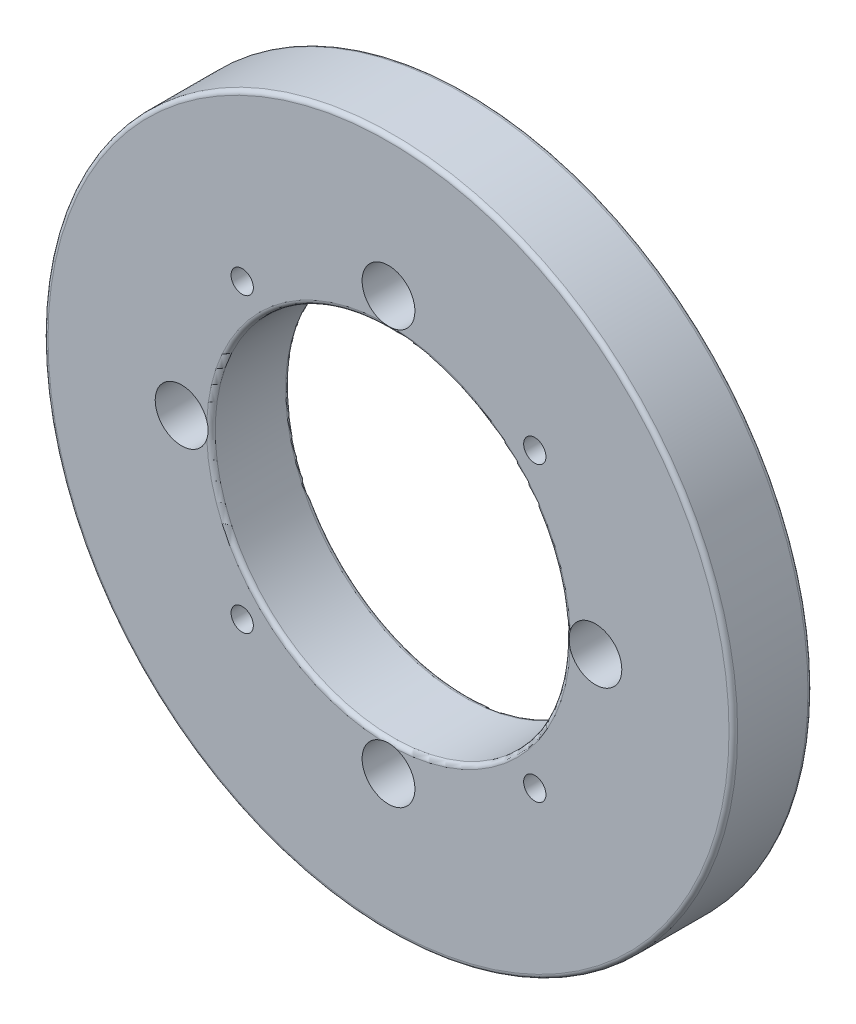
ISO-10303-21;
HEADER;
FILE_DESCRIPTION(('STEP AP214'),'2;1');
FILE_NAME('part.step','',(''),(''),'','','');
FILE_SCHEMA(('AUTOMOTIVE_DESIGN { 1 0 10303 214 1 1 1 1 }'));
ENDSEC;
DATA;
#1=APPLICATION_CONTEXT('core data for automotive mechanical design processes');
#2=APPLICATION_PROTOCOL_DEFINITION('international standard','automotive_design',2000,#1);
#3=PRODUCT_CONTEXT('',#1,'mechanical');
#4=PRODUCT('Part','Part','',(#3));
#5=PRODUCT_RELATED_PRODUCT_CATEGORY('part','',(#4));
#6=PRODUCT_DEFINITION_FORMATION('','',#4);
#7=PRODUCT_DEFINITION_CONTEXT('part definition',#1,'design');
#8=PRODUCT_DEFINITION('design','',#6,#7);
#9=PRODUCT_DEFINITION_SHAPE('','',#8);
#10=(LENGTH_UNIT() NAMED_UNIT(*) SI_UNIT(.MILLI.,.METRE.));
#11=(NAMED_UNIT(*) PLANE_ANGLE_UNIT() SI_UNIT($,.RADIAN.));
#12=(NAMED_UNIT(*) SI_UNIT($,.STERADIAN.) SOLID_ANGLE_UNIT());
#13=UNCERTAINTY_MEASURE_WITH_UNIT(LENGTH_MEASURE(1.E-05),#10,'distance_accuracy_value','');
#14=(GEOMETRIC_REPRESENTATION_CONTEXT(3) GLOBAL_UNCERTAINTY_ASSIGNED_CONTEXT((#13)) GLOBAL_UNIT_ASSIGNED_CONTEXT((#10,
#11,#12)) REPRESENTATION_CONTEXT('',''));
#15=CARTESIAN_POINT('',(0.,0.,0.));
#16=DIRECTION('',(0.,0.,1.));
#17=DIRECTION('',(1.,0.,0.));
#18=AXIS2_PLACEMENT_3D('',#15,#16,#17);
#19=CARTESIAN_POINT('',(0.,0.,29.0957));
#20=DIRECTION('',(0.,0.,1.));
#21=DIRECTION('',(1.,0.,0.));
#22=AXIS2_PLACEMENT_3D('',#19,#20,#21);
#23=PLANE('',#22);
#24=CARTESIAN_POINT('',(-53.8815367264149,53.8815367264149,29.0957));
#25=DIRECTION('',(0.,0.,1.));
#26=DIRECTION('',(1.,0.,0.));
#27=AXIS2_PLACEMENT_3D('',#24,#25,#26);
#28=CIRCLE('',#27,4.10209999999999);
#29=CARTESIAN_POINT('',(-49.7794367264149,53.8815367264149,29.0957));
#30=VERTEX_POINT('',#29);
#31=EDGE_CURVE('E336',#30,#30,#28,.T.);
#32=ORIENTED_EDGE('',*,*,#31,.F.);
#33=EDGE_LOOP('',(#32));
#34=FACE_BOUND('',#33,.T.);
#35=CARTESIAN_POINT('',(53.8815367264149,-53.8815367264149,29.0957));
#36=DIRECTION('',(0.,0.,1.));
#37=DIRECTION('',(1.,0.,0.));
#38=AXIS2_PLACEMENT_3D('',#35,#36,#37);
#39=CIRCLE('',#38,4.10209999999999);
#40=CARTESIAN_POINT('',(57.9836367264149,-53.8815367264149,29.0957));
#41=VERTEX_POINT('',#40);
#42=EDGE_CURVE('E329',#41,#41,#39,.T.);
#43=ORIENTED_EDGE('',*,*,#42,.F.);
#44=EDGE_LOOP('',(#43));
#45=FACE_BOUND('',#44,.T.);
#46=CARTESIAN_POINT('',(-53.8815367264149,-53.8815367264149,29.0957));
#47=DIRECTION('',(0.,0.,1.));
#48=DIRECTION('',(1.,0.,0.));
#49=AXIS2_PLACEMENT_3D('',#46,#47,#48);
#50=CIRCLE('',#49,4.10209999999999);
#51=CARTESIAN_POINT('',(-49.7794367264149,-53.8815367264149,29.0957));
#52=VERTEX_POINT('',#51);
#53=EDGE_CURVE('E321',#52,#52,#50,.T.);
#54=ORIENTED_EDGE('',*,*,#53,.F.);
#55=EDGE_LOOP('',(#54));
#56=FACE_BOUND('',#55,.T.);
#57=CARTESIAN_POINT('',(53.8815367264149,53.8815367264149,29.0957));
#58=DIRECTION('',(0.,0.,1.));
#59=DIRECTION('',(1.,0.,0.));
#60=AXIS2_PLACEMENT_3D('',#57,#58,#59);
#61=CIRCLE('',#60,4.10209999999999);
#62=CARTESIAN_POINT('',(57.9836367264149,53.8815367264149,29.0957));
#63=VERTEX_POINT('',#62);
#64=EDGE_CURVE('E304',#63,#63,#61,.T.);
#65=ORIENTED_EDGE('',*,*,#64,.F.);
#66=EDGE_LOOP('',(#65));
#67=FACE_BOUND('',#66,.T.);
#68=CARTESIAN_POINT('',(0.,0.,29.0957));
#69=DIRECTION('',(0.,0.,1.));
#70=DIRECTION('',(1.,0.,0.));
#71=AXIS2_PLACEMENT_3D('',#68,#69,#70);
#72=CIRCLE('',#71,125.4125);
#73=CARTESIAN_POINT('',(125.4125,0.,29.0957));
#74=VERTEX_POINT('',#73);
#75=EDGE_CURVE('E282',#74,#74,#72,.T.);
#76=ORIENTED_EDGE('',*,*,#75,.T.);
#77=EDGE_LOOP('',(#76));
#78=FACE_BOUND('',#77,.T.);
#79=CARTESIAN_POINT('',(0.,-76.2,29.0957));
#80=DIRECTION('',(0.,0.,1.));
#81=DIRECTION('',(-1.,0.,0.));
#82=AXIS2_PLACEMENT_3D('',#79,#80,#81);
#83=CIRCLE('',#82,9.7234375);
#84=CARTESIAN_POINT('',(-2.92965393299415,-66.9284108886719,29.0957));
#85=VERTEX_POINT('',#84);
#86=CARTESIAN_POINT('',(2.92965393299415,-66.9284108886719,29.0957));
#87=VERTEX_POINT('',#86);
#88=EDGE_CURVE('E308',#85,#87,#83,.T.);
#89=ORIENTED_EDGE('',*,*,#88,.F.);
#90=CARTESIAN_POINT('',(0.,0.,29.0957));
#91=DIRECTION('',(0.,0.,1.));
#92=DIRECTION('',(1.,0.,0.));
#93=AXIS2_PLACEMENT_3D('',#90,#91,#92);
#94=CIRCLE('',#93,66.9925);
#95=CARTESIAN_POINT('',(-66.9284108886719,-2.92965393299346,29.0957));
#96=VERTEX_POINT('',#95);
#97=EDGE_CURVE('E12',#85,#96,#94,.F.);
#98=ORIENTED_EDGE('',*,*,#97,.T.);
#99=CARTESIAN_POINT('',(-76.2,7.9815263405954E-13,29.0957));
#100=DIRECTION('',(0.,0.,1.));
#101=DIRECTION('',(0.,1.,0.));
#102=AXIS2_PLACEMENT_3D('',#99,#100,#101);
#103=CIRCLE('',#102,9.7234375);
#104=CARTESIAN_POINT('',(-66.9284108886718,2.92965393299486,29.0957));
#105=VERTEX_POINT('',#104);
#106=EDGE_CURVE('E299',#105,#96,#103,.T.);
#107=ORIENTED_EDGE('',*,*,#106,.F.);
#108=CARTESIAN_POINT('',(0.,0.,29.0957));
#109=DIRECTION('',(0.,0.,1.));
#110=DIRECTION('',(1.,0.,0.));
#111=AXIS2_PLACEMENT_3D('',#108,#109,#110);
#112=CIRCLE('',#111,66.9925);
#113=CARTESIAN_POINT('',(-2.92965393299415,66.9284108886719,29.0957));
#114=VERTEX_POINT('',#113);
#115=EDGE_CURVE('E60',#105,#114,#112,.F.);
#116=ORIENTED_EDGE('',*,*,#115,.T.);
#117=CARTESIAN_POINT('',(0.,76.2,29.0957));
#118=DIRECTION('',(0.,0.,1.));
#119=DIRECTION('',(1.,0.,0.));
#120=AXIS2_PLACEMENT_3D('',#117,#118,#119);
#121=CIRCLE('',#120,9.7234375);
#122=CARTESIAN_POINT('',(2.92965393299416,66.9284108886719,29.0957));
#123=VERTEX_POINT('',#122);
#124=EDGE_CURVE('E141',#123,#114,#121,.T.);
#125=ORIENTED_EDGE('',*,*,#124,.F.);
#126=CARTESIAN_POINT('',(0.,0.,29.0957));
#127=DIRECTION('',(0.,0.,1.));
#128=DIRECTION('',(1.,0.,0.));
#129=AXIS2_PLACEMENT_3D('',#126,#127,#128);
#130=CIRCLE('',#129,66.9925);
#131=CARTESIAN_POINT('',(66.9284108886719,2.92965393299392,29.0957));
#132=VERTEX_POINT('',#131);
#133=EDGE_CURVE('E360',#123,#132,#130,.F.);
#134=ORIENTED_EDGE('',*,*,#133,.T.);
#135=CARTESIAN_POINT('',(76.2,-2.66050878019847E-13,29.0957));
#136=DIRECTION('',(0.,0.,1.));
#137=DIRECTION('',(0.,-1.,0.));
#138=AXIS2_PLACEMENT_3D('',#135,#136,#137);
#139=CIRCLE('',#138,9.7234375);
#140=CARTESIAN_POINT('',(66.9284108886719,-2.92965393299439,29.0957));
#141=VERTEX_POINT('',#140);
#142=EDGE_CURVE('E142',#141,#132,#139,.T.);
#143=ORIENTED_EDGE('',*,*,#142,.F.);
#144=CARTESIAN_POINT('',(0.,0.,29.0957));
#145=DIRECTION('',(0.,0.,1.));
#146=DIRECTION('',(1.,0.,0.));
#147=AXIS2_PLACEMENT_3D('',#144,#145,#146);
#148=CIRCLE('',#147,66.9925);
#149=EDGE_CURVE('E355',#141,#87,#148,.F.);
#150=ORIENTED_EDGE('',*,*,#149,.T.);
#151=EDGE_LOOP('',(#89,#98,#107,#116,#125,#134,#143,#150));
#152=FACE_BOUND('',#151,.T.);
#153=ADVANCED_FACE('F50',(#34,#45,#56,#67,#78,#152),#23,.T.);
#154=CARTESIAN_POINT('',(0.,0.,0.));
#155=DIRECTION('',(0.,0.,1.));
#156=DIRECTION('',(1.,0.,0.));
#157=AXIS2_PLACEMENT_3D('',#154,#155,#156);
#158=PLANE('',#157);
#159=CARTESIAN_POINT('',(-53.8815367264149,53.8815367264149,0.));
#160=DIRECTION('',(0.,0.,-1.));
#161=DIRECTION('',(-1.,0.,0.));
#162=AXIS2_PLACEMENT_3D('',#159,#160,#161);
#163=CIRCLE('',#162,4.1021);
#164=CARTESIAN_POINT('',(-57.9836367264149,53.8815367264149,0.));
#165=VERTEX_POINT('',#164);
#166=EDGE_CURVE('E338',#165,#165,#163,.T.);
#167=ORIENTED_EDGE('',*,*,#166,.F.);
#168=EDGE_LOOP('',(#167));
#169=FACE_BOUND('',#168,.T.);
#170=CARTESIAN_POINT('',(53.8815367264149,-53.8815367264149,0.));
#171=DIRECTION('',(0.,0.,-1.));
#172=DIRECTION('',(-1.,0.,0.));
#173=AXIS2_PLACEMENT_3D('',#170,#171,#172);
#174=CIRCLE('',#173,4.1021);
#175=CARTESIAN_POINT('',(49.7794367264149,-53.8815367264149,0.));
#176=VERTEX_POINT('',#175);
#177=EDGE_CURVE('E332',#176,#176,#174,.T.);
#178=ORIENTED_EDGE('',*,*,#177,.F.);
#179=EDGE_LOOP('',(#178));
#180=FACE_BOUND('',#179,.T.);
#181=CARTESIAN_POINT('',(-53.8815367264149,-53.8815367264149,0.));
#182=DIRECTION('',(0.,0.,-1.));
#183=DIRECTION('',(-1.,0.,0.));
#184=AXIS2_PLACEMENT_3D('',#181,#182,#183);
#185=CIRCLE('',#184,4.1021);
#186=CARTESIAN_POINT('',(-57.9836367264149,-53.8815367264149,0.));
#187=VERTEX_POINT('',#186);
#188=EDGE_CURVE('E325',#187,#187,#185,.T.);
#189=ORIENTED_EDGE('',*,*,#188,.F.);
#190=EDGE_LOOP('',(#189));
#191=FACE_BOUND('',#190,.T.);
#192=CARTESIAN_POINT('',(53.8815367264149,53.8815367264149,0.));
#193=DIRECTION('',(0.,0.,-1.));
#194=DIRECTION('',(-1.,0.,0.));
#195=AXIS2_PLACEMENT_3D('',#192,#193,#194);
#196=CIRCLE('',#195,4.1021);
#197=CARTESIAN_POINT('',(49.7794367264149,53.8815367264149,0.));
#198=VERTEX_POINT('',#197);
#199=EDGE_CURVE('E318',#198,#198,#196,.T.);
#200=ORIENTED_EDGE('',*,*,#199,.F.);
#201=EDGE_LOOP('',(#200));
#202=FACE_BOUND('',#201,.T.);
#203=CARTESIAN_POINT('',(0.,0.,0.));
#204=DIRECTION('',(0.,0.,1.));
#205=DIRECTION('',(1.,0.,0.));
#206=AXIS2_PLACEMENT_3D('',#203,#204,#205);
#207=CIRCLE('',#206,125.4125);
#208=CARTESIAN_POINT('',(125.4125,0.,0.));
#209=VERTEX_POINT('',#208);
#210=EDGE_CURVE('E148',#209,#209,#207,.F.);
#211=ORIENTED_EDGE('',*,*,#210,.T.);
#212=EDGE_LOOP('',(#211));
#213=FACE_BOUND('',#212,.T.);
#214=CARTESIAN_POINT('',(0.,76.2,0.));
#215=DIRECTION('',(0.,0.,1.));
#216=DIRECTION('',(1.,0.,0.));
#217=AXIS2_PLACEMENT_3D('',#214,#215,#216);
#218=CIRCLE('',#217,9.7234375);
#219=CARTESIAN_POINT('',(2.92965393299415,66.9284108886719,0.));
#220=VERTEX_POINT('',#219);
#221=CARTESIAN_POINT('',(-2.92965393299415,66.9284108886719,0.));
#222=VERTEX_POINT('',#221);
#223=EDGE_CURVE('E286',#220,#222,#218,.T.);
#224=ORIENTED_EDGE('',*,*,#223,.T.);
#225=CARTESIAN_POINT('',(0.,0.,0.));
#226=DIRECTION('',(0.,0.,1.));
#227=DIRECTION('',(1.,0.,0.));
#228=AXIS2_PLACEMENT_3D('',#225,#226,#227);
#229=CIRCLE('',#228,66.9925);
#230=CARTESIAN_POINT('',(-66.9284108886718,2.92965393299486,0.));
#231=VERTEX_POINT('',#230);
#232=EDGE_CURVE('E161',#222,#231,#229,.T.);
#233=ORIENTED_EDGE('',*,*,#232,.T.);
#234=CARTESIAN_POINT('',(-76.2,7.9815263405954E-13,0.));
#235=DIRECTION('',(0.,0.,1.));
#236=DIRECTION('',(0.,1.,0.));
#237=AXIS2_PLACEMENT_3D('',#234,#235,#236);
#238=CIRCLE('',#237,9.7234375);
#239=CARTESIAN_POINT('',(-66.9284108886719,-2.92965393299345,0.));
#240=VERTEX_POINT('',#239);
#241=EDGE_CURVE('E303',#231,#240,#238,.T.);
#242=ORIENTED_EDGE('',*,*,#241,.T.);
#243=CARTESIAN_POINT('',(0.,0.,0.));
#244=DIRECTION('',(0.,0.,1.));
#245=DIRECTION('',(1.,0.,0.));
#246=AXIS2_PLACEMENT_3D('',#243,#244,#245);
#247=CIRCLE('',#246,66.9925);
#248=CARTESIAN_POINT('',(-2.92965393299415,-66.9284108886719,0.));
#249=VERTEX_POINT('',#248);
#250=EDGE_CURVE('E151',#240,#249,#247,.T.);
#251=ORIENTED_EDGE('',*,*,#250,.T.);
#252=CARTESIAN_POINT('',(0.,-76.2,0.));
#253=DIRECTION('',(0.,0.,1.));
#254=DIRECTION('',(-1.,0.,0.));
#255=AXIS2_PLACEMENT_3D('',#252,#253,#254);
#256=CIRCLE('',#255,9.7234375);
#257=CARTESIAN_POINT('',(2.92965393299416,-66.9284108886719,0.));
#258=VERTEX_POINT('',#257);
#259=EDGE_CURVE('E311',#249,#258,#256,.T.);
#260=ORIENTED_EDGE('',*,*,#259,.T.);
#261=CARTESIAN_POINT('',(0.,0.,0.));
#262=DIRECTION('',(0.,0.,1.));
#263=DIRECTION('',(1.,0.,0.));
#264=AXIS2_PLACEMENT_3D('',#261,#262,#263);
#265=CIRCLE('',#264,66.9925);
#266=CARTESIAN_POINT('',(66.9284108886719,-2.92965393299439,0.));
#267=VERTEX_POINT('',#266);
#268=EDGE_CURVE('E139',#258,#267,#265,.T.);
#269=ORIENTED_EDGE('',*,*,#268,.T.);
#270=CARTESIAN_POINT('',(76.2,-2.66050878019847E-13,0.));
#271=DIRECTION('',(0.,0.,1.));
#272=DIRECTION('',(0.,-1.,0.));
#273=AXIS2_PLACEMENT_3D('',#270,#271,#272);
#274=CIRCLE('',#273,9.7234375);
#275=CARTESIAN_POINT('',(66.9284108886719,2.92965393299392,0.));
#276=VERTEX_POINT('',#275);
#277=EDGE_CURVE('E127',#267,#276,#274,.T.);
#278=ORIENTED_EDGE('',*,*,#277,.T.);
#279=CARTESIAN_POINT('',(0.,0.,0.));
#280=DIRECTION('',(0.,0.,1.));
#281=DIRECTION('',(1.,0.,0.));
#282=AXIS2_PLACEMENT_3D('',#279,#280,#281);
#283=CIRCLE('',#282,66.9925);
#284=EDGE_CURVE('E136',#276,#220,#283,.T.);
#285=ORIENTED_EDGE('',*,*,#284,.T.);
#286=EDGE_LOOP('',(#224,#233,#242,#251,#260,#269,#278,#285));
#287=FACE_BOUND('',#286,.T.);
#288=ADVANCED_FACE('F135',(#169,#180,#191,#202,#213,#287),#158,.F.);
#289=CARTESIAN_POINT('',(0.,0.,29.0957));
#290=DIRECTION('',(0.,0.,-1.));
#291=DIRECTION('',(-1.,0.,0.));
#292=AXIS2_PLACEMENT_3D('',#289,#290,#291);
#293=CYLINDRICAL_SURFACE('',#292,127.);
#294=CARTESIAN_POINT('',(0.,0.,27.5082));
#295=DIRECTION('',(0.,0.,1.));
#296=DIRECTION('',(1.,0.,0.));
#297=AXIS2_PLACEMENT_3D('',#294,#295,#296);
#298=CIRCLE('',#297,127.);
#299=CARTESIAN_POINT('',(127.,0.,27.5082));
#300=VERTEX_POINT('',#299);
#301=EDGE_CURVE('E155',#300,#300,#298,.F.);
#302=ORIENTED_EDGE('',*,*,#301,.T.);
#303=EDGE_LOOP('',(#302));
#304=FACE_BOUND('',#303,.T.);
#305=CARTESIAN_POINT('',(0.,0.,1.5875));
#306=DIRECTION('',(0.,0.,1.));
#307=DIRECTION('',(1.,0.,0.));
#308=AXIS2_PLACEMENT_3D('',#305,#306,#307);
#309=CIRCLE('',#308,127.);
#310=CARTESIAN_POINT('',(127.,0.,1.5875));
#311=VERTEX_POINT('',#310);
#312=EDGE_CURVE('E285',#311,#311,#309,.T.);
#313=ORIENTED_EDGE('',*,*,#312,.T.);
#314=EDGE_LOOP('',(#313));
#315=FACE_BOUND('',#314,.T.);
#316=ADVANCED_FACE('F263',(#304,#315),#293,.T.);
#317=CARTESIAN_POINT('',(0.,0.,29.0957));
#318=DIRECTION('',(0.,0.,-1.));
#319=DIRECTION('',(-1.,0.,0.));
#320=AXIS2_PLACEMENT_3D('',#317,#318,#319);
#321=CYLINDRICAL_SURFACE('',#320,65.405);
#322=CARTESIAN_POINT('',(0.,0.,1.5875));
#323=DIRECTION('',(0.,0.,1.));
#324=DIRECTION('',(1.,0.,0.));
#325=AXIS2_PLACEMENT_3D('',#322,#323,#324);
#326=CIRCLE('',#325,65.405);
#327=CARTESIAN_POINT('',(65.405,0.,1.5875));
#328=VERTEX_POINT('',#327);
#329=EDGE_CURVE('E353',#328,#328,#326,.F.);
#330=ORIENTED_EDGE('',*,*,#329,.T.);
#331=EDGE_LOOP('',(#330));
#332=FACE_BOUND('',#331,.T.);
#333=CARTESIAN_POINT('',(0.,0.,27.5082));
#334=DIRECTION('',(0.,0.,1.));
#335=DIRECTION('',(1.,0.,0.));
#336=AXIS2_PLACEMENT_3D('',#333,#334,#335);
#337=CIRCLE('',#336,65.405);
#338=CARTESIAN_POINT('',(65.405,0.,27.5082));
#339=VERTEX_POINT('',#338);
#340=EDGE_CURVE('E208',#339,#339,#337,.T.);
#341=ORIENTED_EDGE('',*,*,#340,.T.);
#342=EDGE_LOOP('',(#341));
#343=FACE_BOUND('',#342,.T.);
#344=ADVANCED_FACE('F193',(#332,#343),#321,.F.);
#345=CARTESIAN_POINT('',(0.,76.2,0.));
#346=DIRECTION('',(0.,0.,1.));
#347=DIRECTION('',(1.,0.,0.));
#348=AXIS2_PLACEMENT_3D('',#345,#346,#347);
#349=CYLINDRICAL_SURFACE('',#348,9.7234375);
#350=ORIENTED_EDGE('',*,*,#223,.F.);
#351=CARTESIAN_POINT('',(2.92965393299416,66.9284108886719,0.));
#352=CARTESIAN_POINT('',(2.80301925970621,66.8883948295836,3.25155409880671E-05));
#353=CARTESIAN_POINT('',(2.6755915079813,66.8509851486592,0.00195686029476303));
#354=CARTESIAN_POINT('',(2.41939369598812,66.781434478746,0.00833920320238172));
#355=CARTESIAN_POINT('',(2.29062392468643,66.7492923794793,0.0127966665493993));
#356=CARTESIAN_POINT('',(2.03184266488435,66.6902954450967,0.0229998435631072));
#357=CARTESIAN_POINT('',(1.90183037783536,66.66344428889,0.0287464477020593));
#358=CARTESIAN_POINT('',(1.64081962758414,66.6150866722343,0.0404807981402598));
#359=CARTESIAN_POINT('',(1.50982111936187,66.5935804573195,0.0464685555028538));
#360=CARTESIAN_POINT('',(1.25034497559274,66.5564210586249,0.0576429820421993));
#361=CARTESIAN_POINT('',(1.12188726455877,66.5406337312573,0.0628460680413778));
#362=CARTESIAN_POINT('',(0.864398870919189,66.5141959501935,0.0719617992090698));
#363=CARTESIAN_POINT('',(0.735368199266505,66.5035453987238,0.0758744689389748));
#364=CARTESIAN_POINT('',(0.47701605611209,66.4874084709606,0.0819326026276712));
#365=CARTESIAN_POINT('',(0.34769479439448,66.4819191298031,0.0840790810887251));
#366=CARTESIAN_POINT('',(0.0889187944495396,66.4761078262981,0.0863538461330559));
#367=CARTESIAN_POINT('',(-0.0405359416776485,66.4757857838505,0.0864821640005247));
#368=CARTESIAN_POINT('',(-0.285525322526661,66.4800680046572,0.0848026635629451));
#369=CARTESIAN_POINT('',(-0.401070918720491,66.4841501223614,0.0832000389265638));
#370=CARTESIAN_POINT('',(-0.631922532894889,66.4964299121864,0.0785278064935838));
#371=CARTESIAN_POINT('',(-0.747228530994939,66.5046279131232,0.0754580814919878));
#372=CARTESIAN_POINT('',(-0.977473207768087,66.5251281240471,0.0681449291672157));
#373=CARTESIAN_POINT('',(-1.09241175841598,66.5374316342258,0.063901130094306));
#374=CARTESIAN_POINT('',(-1.32174793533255,66.5661236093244,0.0546641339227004));
#375=CARTESIAN_POINT('',(-1.43614555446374,66.5825121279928,0.0496709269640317));
#376=CARTESIAN_POINT('',(-1.66692424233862,66.6197819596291,0.0393504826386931));
#377=CARTESIAN_POINT('',(-1.78328966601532,66.6407587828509,0.0340181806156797));
#378=CARTESIAN_POINT('',(-2.01519205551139,66.6869449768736,0.0238073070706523));
#379=CARTESIAN_POINT('',(-2.13072905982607,66.7121541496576,0.0189287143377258));
#380=CARTESIAN_POINT('',(-2.36081187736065,66.7667727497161,0.0103959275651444));
#381=CARTESIAN_POINT('',(-2.47535804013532,66.7961806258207,0.00674128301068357));
#382=CARTESIAN_POINT('',(-2.70336523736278,66.8591728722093,0.00155356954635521));
#383=CARTESIAN_POINT('',(-2.81682606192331,66.8927580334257,2.09030829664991E-05));
#384=CARTESIAN_POINT('',(-2.92965393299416,66.9284108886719,0.));
#385=B_SPLINE_CURVE_WITH_KNOTS('',3,(#351,#352,#353,#354,#355,#356,#357,#358,#359,#360,#361,
#362,#363,#364,#365,#366,#367,#368,#369,#370,#371,#372,#373,#374,#375,#376,#377,#378,#379,#380,
#381,#382,#383,#384),.UNSPECIFIED.,.F.,.F.,(4,2,2,2,2,2,2,2,2,2,2,2,2,2,2,2,4),(0.,
0.39833908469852,0.796594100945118,1.195125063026,1.59367432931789,1.98215469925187,
2.37062767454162,2.75887735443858,3.14712101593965,3.49392507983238,3.84075685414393,
4.18769857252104,4.53464485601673,4.88964943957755,5.24463741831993,5.59949458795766,
5.95441904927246),.UNSPECIFIED.);
#386=EDGE_CURVE('E147',#220,#222,#385,.T.);
#387=ORIENTED_EDGE('',*,*,#386,.T.);
#388=EDGE_LOOP('',(#350,#387));
#389=FACE_BOUND('',#388,.T.);
#390=ORIENTED_EDGE('',*,*,#124,.T.);
#391=CARTESIAN_POINT('',(-2.92965393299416,66.9284108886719,29.0957));
#392=CARTESIAN_POINT('',(-2.80301925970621,66.8883948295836,29.095667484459));
#393=CARTESIAN_POINT('',(-2.6755915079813,66.8509851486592,29.0937431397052));
#394=CARTESIAN_POINT('',(-2.41939369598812,66.781434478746,29.0873607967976));
#395=CARTESIAN_POINT('',(-2.29062392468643,66.7492923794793,29.0829033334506));
#396=CARTESIAN_POINT('',(-2.03184266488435,66.6902954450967,29.0727001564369));
#397=CARTESIAN_POINT('',(-1.90183037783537,66.66344428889,29.0669535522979));
#398=CARTESIAN_POINT('',(-1.64081962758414,66.6150866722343,29.0552192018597));
#399=CARTESIAN_POINT('',(-1.50982111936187,66.5935804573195,29.0492314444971));
#400=CARTESIAN_POINT('',(-1.25034497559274,66.5564210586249,29.0380570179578));
#401=CARTESIAN_POINT('',(-1.12188726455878,66.5406337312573,29.0328539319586));
#402=CARTESIAN_POINT('',(-0.864398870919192,66.5141959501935,29.0237382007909));
#403=CARTESIAN_POINT('',(-0.735368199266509,66.5035453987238,29.019825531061));
#404=CARTESIAN_POINT('',(-0.477016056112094,66.4874084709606,29.0137673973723));
#405=CARTESIAN_POINT('',(-0.347694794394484,66.4819191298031,29.0116209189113));
#406=CARTESIAN_POINT('',(-0.0889187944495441,66.4761078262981,29.0093461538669));
#407=CARTESIAN_POINT('',(0.0405359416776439,66.4757857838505,29.0092178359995));
#408=CARTESIAN_POINT('',(0.285525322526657,66.4800680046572,29.0108973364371));
#409=CARTESIAN_POINT('',(0.401070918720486,66.4841501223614,29.0124999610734));
#410=CARTESIAN_POINT('',(0.631922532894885,66.4964299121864,29.0171721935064));
#411=CARTESIAN_POINT('',(0.747228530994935,66.5046279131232,29.020241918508));
#412=CARTESIAN_POINT('',(0.977473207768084,66.5251281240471,29.0275550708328));
#413=CARTESIAN_POINT('',(1.09241175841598,66.5374316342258,29.0317988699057));
#414=CARTESIAN_POINT('',(1.32174793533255,66.5661236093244,29.0410358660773));
#415=CARTESIAN_POINT('',(1.43614555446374,66.5825121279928,29.046029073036));
#416=CARTESIAN_POINT('',(1.66692424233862,66.6197819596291,29.0563495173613));
#417=CARTESIAN_POINT('',(1.78328966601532,66.6407587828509,29.0616818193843));
#418=CARTESIAN_POINT('',(2.01519205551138,66.6869449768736,29.0718926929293));
#419=CARTESIAN_POINT('',(2.13072905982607,66.7121541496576,29.0767712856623));
#420=CARTESIAN_POINT('',(2.36081187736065,66.7667727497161,29.0853040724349));
#421=CARTESIAN_POINT('',(2.47535804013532,66.7961806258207,29.0889587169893));
#422=CARTESIAN_POINT('',(2.70336523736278,66.8591728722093,29.0941464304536));
#423=CARTESIAN_POINT('',(2.81682606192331,66.8927580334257,29.095679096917));
#424=CARTESIAN_POINT('',(2.92965393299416,66.9284108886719,29.0957));
#425=B_SPLINE_CURVE_WITH_KNOTS('',3,(#391,#392,#393,#394,#395,#396,#397,#398,#399,#400,#401,
#402,#403,#404,#405,#406,#407,#408,#409,#410,#411,#412,#413,#414,#415,#416,#417,#418,#419,#420,
#421,#422,#423,#424),.UNSPECIFIED.,.F.,.F.,(4,2,2,2,2,2,2,2,2,2,2,2,2,2,2,2,4),(0.,
0.39833908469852,0.796594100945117,1.195125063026,1.59367432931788,1.98215469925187,
2.37062767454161,2.75887735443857,3.14712101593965,3.49392507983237,3.84075685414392,
4.18769857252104,4.53464485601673,4.88964943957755,5.24463741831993,5.59949458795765,
5.95441904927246),.UNSPECIFIED.);
#426=EDGE_CURVE('E66',#114,#123,#425,.T.);
#427=ORIENTED_EDGE('',*,*,#426,.T.);
#428=EDGE_LOOP('',(#390,#427));
#429=FACE_BOUND('',#428,.T.);
#430=ADVANCED_FACE('F185',(#389,#429),#349,.F.);
#431=CARTESIAN_POINT('',(-76.2,7.9815263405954E-13,0.));
#432=DIRECTION('',(0.,0.,1.));
#433=DIRECTION('',(1.,0.,0.));
#434=AXIS2_PLACEMENT_3D('',#431,#432,#433);
#435=CYLINDRICAL_SURFACE('',#434,9.7234375);
#436=ORIENTED_EDGE('',*,*,#241,.F.);
#437=CARTESIAN_POINT('',(-66.9284108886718,2.92965393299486,0.));
#438=CARTESIAN_POINT('',(-66.8883948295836,2.80301925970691,3.25155409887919E-05));
#439=CARTESIAN_POINT('',(-66.8509851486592,2.675591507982,0.00195686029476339));
#440=CARTESIAN_POINT('',(-66.7814344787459,2.41939369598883,0.00833920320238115));
#441=CARTESIAN_POINT('',(-66.7492923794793,2.29062392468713,0.0127966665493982));
#442=CARTESIAN_POINT('',(-66.6902954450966,2.03184266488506,0.0229998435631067));
#443=CARTESIAN_POINT('',(-66.66344428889,1.90183037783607,0.0287464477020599));
#444=CARTESIAN_POINT('',(-66.6150866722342,1.64081962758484,0.0404807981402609));
#445=CARTESIAN_POINT('',(-66.5935804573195,1.50982111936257,0.0464685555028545));
#446=CARTESIAN_POINT('',(-66.5564210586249,1.25034497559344,0.0576429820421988));
#447=CARTESIAN_POINT('',(-66.5406337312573,1.12188726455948,0.0628460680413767));
#448=CARTESIAN_POINT('',(-66.5141959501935,0.864398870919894,0.0719617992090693));
#449=CARTESIAN_POINT('',(-66.5035453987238,0.73536819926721,0.0758744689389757));
#450=CARTESIAN_POINT('',(-66.4874084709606,0.477016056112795,0.0819326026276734));
#451=CARTESIAN_POINT('',(-66.4819191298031,0.347694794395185,0.0840790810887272));
#452=CARTESIAN_POINT('',(-66.4761078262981,0.088918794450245,0.0863538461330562));
#453=CARTESIAN_POINT('',(-66.4757857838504,-0.0405359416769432,0.0864821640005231));
#454=CARTESIAN_POINT('',(-66.4800680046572,-0.285525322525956,0.0848026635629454));
#455=CARTESIAN_POINT('',(-66.4841501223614,-0.401070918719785,0.083200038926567));
#456=CARTESIAN_POINT('',(-66.4964299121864,-0.631922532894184,0.0785278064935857));
#457=CARTESIAN_POINT('',(-66.5046279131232,-0.747228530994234,0.0754580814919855));
#458=CARTESIAN_POINT('',(-66.5251281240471,-0.977473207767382,0.0681449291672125));
#459=CARTESIAN_POINT('',(-66.5374316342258,-1.09241175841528,0.0639011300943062));
#460=CARTESIAN_POINT('',(-66.5661236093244,-1.32174793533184,0.0546641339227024));
#461=CARTESIAN_POINT('',(-66.5825121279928,-1.43614555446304,0.0496709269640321));
#462=CARTESIAN_POINT('',(-66.6197819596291,-1.66692424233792,0.0393504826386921));
#463=CARTESIAN_POINT('',(-66.6407587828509,-1.78328966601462,0.034018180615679));
#464=CARTESIAN_POINT('',(-66.6869449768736,-2.01519205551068,0.0238073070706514));
#465=CARTESIAN_POINT('',(-66.7121541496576,-2.13072905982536,0.0189287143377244));
#466=CARTESIAN_POINT('',(-66.7667727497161,-2.36081187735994,0.0103959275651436));
#467=CARTESIAN_POINT('',(-66.7961806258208,-2.47535804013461,0.00674128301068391));
#468=CARTESIAN_POINT('',(-66.8591728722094,-2.70336523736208,0.00155356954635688));
#469=CARTESIAN_POINT('',(-66.8927580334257,-2.81682606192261,2.09030829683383E-05));
#470=CARTESIAN_POINT('',(-66.9284108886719,-2.92965393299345,0.));
#471=B_SPLINE_CURVE_WITH_KNOTS('',3,(#437,#438,#439,#440,#441,#442,#443,#444,#445,#446,#447,
#448,#449,#450,#451,#452,#453,#454,#455,#456,#457,#458,#459,#460,#461,#462,#463,#464,#465,#466,
#467,#468,#469,#470),.UNSPECIFIED.,.F.,.F.,(4,2,2,2,2,2,2,2,2,2,2,2,2,2,2,2,4),(0.,
0.398339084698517,0.796594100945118,1.195125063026,1.59367432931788,1.98215469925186,
2.37062767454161,2.75887735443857,3.14712101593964,3.49392507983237,3.84075685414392,
4.18769857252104,4.53464485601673,4.88964943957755,5.24463741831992,5.59949458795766,
5.95441904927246),.UNSPECIFIED.);
#472=EDGE_CURVE('E173',#231,#240,#471,.T.);
#473=ORIENTED_EDGE('',*,*,#472,.T.);
#474=EDGE_LOOP('',(#436,#473));
#475=FACE_BOUND('',#474,.T.);
#476=ORIENTED_EDGE('',*,*,#106,.T.);
#477=CARTESIAN_POINT('',(-66.9284108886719,-2.92965393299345,29.0957));
#478=CARTESIAN_POINT('',(-66.8883948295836,-2.80301925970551,29.095667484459));
#479=CARTESIAN_POINT('',(-66.8509851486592,-2.67559150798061,29.0937431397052));
#480=CARTESIAN_POINT('',(-66.781434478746,-2.41939369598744,29.0873607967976));
#481=CARTESIAN_POINT('',(-66.7492923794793,-2.29062392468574,29.0829033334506));
#482=CARTESIAN_POINT('',(-66.6902954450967,-2.03184266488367,29.0727001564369));
#483=CARTESIAN_POINT('',(-66.66344428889,-1.90183037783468,29.0669535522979));
#484=CARTESIAN_POINT('',(-66.6150866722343,-1.64081962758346,29.0552192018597));
#485=CARTESIAN_POINT('',(-66.5935804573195,-1.50982111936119,29.0492314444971));
#486=CARTESIAN_POINT('',(-66.5564210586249,-1.25034497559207,29.0380570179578));
#487=CARTESIAN_POINT('',(-66.5406337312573,-1.1218872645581,29.0328539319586));
#488=CARTESIAN_POINT('',(-66.5141959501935,-0.864398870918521,29.0237382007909));
#489=CARTESIAN_POINT('',(-66.5035453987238,-0.735368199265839,29.019825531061));
#490=CARTESIAN_POINT('',(-66.4874084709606,-0.477016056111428,29.0137673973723));
#491=CARTESIAN_POINT('',(-66.4819191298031,-0.34769479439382,29.0116209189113));
#492=CARTESIAN_POINT('',(-66.4761078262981,-0.0889187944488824,29.0093461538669));
#493=CARTESIAN_POINT('',(-66.4757857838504,0.0405359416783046,29.0092178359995));
#494=CARTESIAN_POINT('',(-66.4800680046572,0.285525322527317,29.0108973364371));
#495=CARTESIAN_POINT('',(-66.4841501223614,0.401070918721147,29.0124999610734));
#496=CARTESIAN_POINT('',(-66.4964299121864,0.631922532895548,29.0171721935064));
#497=CARTESIAN_POINT('',(-66.5046279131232,0.7472285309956,29.020241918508));
#498=CARTESIAN_POINT('',(-66.5251281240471,0.977473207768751,29.0275550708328));
#499=CARTESIAN_POINT('',(-66.5374316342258,1.09241175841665,29.0317988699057));
#500=CARTESIAN_POINT('',(-66.5661236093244,1.32174793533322,29.0410358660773));
#501=CARTESIAN_POINT('',(-66.5825121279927,1.43614555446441,29.046029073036));
#502=CARTESIAN_POINT('',(-66.6197819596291,1.66692424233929,29.0563495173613));
#503=CARTESIAN_POINT('',(-66.6407587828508,1.783289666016,29.0616818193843));
#504=CARTESIAN_POINT('',(-66.6869449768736,2.01519205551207,29.0718926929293));
#505=CARTESIAN_POINT('',(-66.7121541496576,2.13072905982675,29.0767712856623));
#506=CARTESIAN_POINT('',(-66.766772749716,2.36081187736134,29.0853040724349));
#507=CARTESIAN_POINT('',(-66.7961806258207,2.47535804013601,29.0889587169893));
#508=CARTESIAN_POINT('',(-66.8591728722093,2.70336523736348,29.0941464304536));
#509=CARTESIAN_POINT('',(-66.8927580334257,2.81682606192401,29.095679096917));
#510=CARTESIAN_POINT('',(-66.9284108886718,2.92965393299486,29.0957));
#511=B_SPLINE_CURVE_WITH_KNOTS('',3,(#477,#478,#479,#480,#481,#482,#483,#484,#485,#486,#487,
#488,#489,#490,#491,#492,#493,#494,#495,#496,#497,#498,#499,#500,#501,#502,#503,#504,#505,#506,
#507,#508,#509,#510),.UNSPECIFIED.,.F.,.F.,(4,2,2,2,2,2,2,2,2,2,2,2,2,2,2,2,4),(0.,
0.398339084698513,0.796594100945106,1.19512506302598,1.59367432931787,1.98215469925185,
2.37062767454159,2.75887735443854,3.14712101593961,3.49392507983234,3.84075685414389,
4.18769857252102,4.53464485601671,4.88964943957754,5.24463741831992,5.59949458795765,
5.95441904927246),.UNSPECIFIED.);
#512=EDGE_CURVE('E165',#96,#105,#511,.T.);
#513=ORIENTED_EDGE('',*,*,#512,.T.);
#514=EDGE_LOOP('',(#476,#513));
#515=FACE_BOUND('',#514,.T.);
#516=ADVANCED_FACE('F179',(#475,#515),#435,.F.);
#517=CARTESIAN_POINT('',(0.,-76.2,0.));
#518=DIRECTION('',(0.,0.,1.));
#519=DIRECTION('',(1.,0.,0.));
#520=AXIS2_PLACEMENT_3D('',#517,#518,#519);
#521=CYLINDRICAL_SURFACE('',#520,9.7234375);
#522=ORIENTED_EDGE('',*,*,#259,.F.);
#523=CARTESIAN_POINT('',(-2.92965393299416,-66.9284108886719,0.));
#524=CARTESIAN_POINT('',(-2.80301925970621,-66.8883948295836,3.25155409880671E-05));
#525=CARTESIAN_POINT('',(-2.6755915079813,-66.8509851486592,0.00195686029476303));
#526=CARTESIAN_POINT('',(-2.41939369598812,-66.781434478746,0.00833920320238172));
#527=CARTESIAN_POINT('',(-2.29062392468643,-66.7492923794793,0.0127966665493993));
#528=CARTESIAN_POINT('',(-2.03184266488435,-66.6902954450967,0.0229998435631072));
#529=CARTESIAN_POINT('',(-1.90183037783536,-66.66344428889,0.0287464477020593));
#530=CARTESIAN_POINT('',(-1.64081962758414,-66.6150866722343,0.0404807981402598));
#531=CARTESIAN_POINT('',(-1.50982111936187,-66.5935804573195,0.0464685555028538));
#532=CARTESIAN_POINT('',(-1.25034497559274,-66.5564210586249,0.0576429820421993));
#533=CARTESIAN_POINT('',(-1.12188726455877,-66.5406337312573,0.0628460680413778));
#534=CARTESIAN_POINT('',(-0.864398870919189,-66.5141959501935,0.0719617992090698));
#535=CARTESIAN_POINT('',(-0.735368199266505,-66.5035453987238,0.0758744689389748));
#536=CARTESIAN_POINT('',(-0.47701605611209,-66.4874084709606,0.0819326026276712));
#537=CARTESIAN_POINT('',(-0.34769479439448,-66.4819191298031,0.0840790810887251));
#538=CARTESIAN_POINT('',(-0.0889187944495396,-66.4761078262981,0.0863538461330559));
#539=CARTESIAN_POINT('',(0.0405359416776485,-66.4757857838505,0.0864821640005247));
#540=CARTESIAN_POINT('',(0.285525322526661,-66.4800680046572,0.0848026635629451));
#541=CARTESIAN_POINT('',(0.401070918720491,-66.4841501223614,0.0832000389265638));
#542=CARTESIAN_POINT('',(0.631922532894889,-66.4964299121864,0.0785278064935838));
#543=CARTESIAN_POINT('',(0.747228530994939,-66.5046279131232,0.0754580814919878));
#544=CARTESIAN_POINT('',(0.977473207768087,-66.5251281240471,0.0681449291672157));
#545=CARTESIAN_POINT('',(1.09241175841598,-66.5374316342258,0.063901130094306));
#546=CARTESIAN_POINT('',(1.32174793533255,-66.5661236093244,0.0546641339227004));
#547=CARTESIAN_POINT('',(1.43614555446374,-66.5825121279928,0.0496709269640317));
#548=CARTESIAN_POINT('',(1.66692424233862,-66.6197819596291,0.0393504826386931));
#549=CARTESIAN_POINT('',(1.78328966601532,-66.6407587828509,0.0340181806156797));
#550=CARTESIAN_POINT('',(2.01519205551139,-66.6869449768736,0.0238073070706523));
#551=CARTESIAN_POINT('',(2.13072905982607,-66.7121541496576,0.0189287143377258));
#552=CARTESIAN_POINT('',(2.36081187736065,-66.7667727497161,0.0103959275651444));
#553=CARTESIAN_POINT('',(2.47535804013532,-66.7961806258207,0.00674128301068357));
#554=CARTESIAN_POINT('',(2.70336523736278,-66.8591728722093,0.00155356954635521));
#555=CARTESIAN_POINT('',(2.81682606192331,-66.8927580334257,2.09030829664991E-05));
#556=CARTESIAN_POINT('',(2.92965393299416,-66.9284108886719,0.));
#557=B_SPLINE_CURVE_WITH_KNOTS('',3,(#523,#524,#525,#526,#527,#528,#529,#530,#531,#532,#533,
#534,#535,#536,#537,#538,#539,#540,#541,#542,#543,#544,#545,#546,#547,#548,#549,#550,#551,#552,
#553,#554,#555,#556),.UNSPECIFIED.,.F.,.F.,(4,2,2,2,2,2,2,2,2,2,2,2,2,2,2,2,4),(0.,
0.39833908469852,0.796594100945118,1.195125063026,1.59367432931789,1.98215469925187,
2.37062767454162,2.75887735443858,3.14712101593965,3.49392507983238,3.84075685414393,
4.18769857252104,4.53464485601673,4.88964943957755,5.24463741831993,5.59949458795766,
5.95441904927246),.UNSPECIFIED.);
#558=EDGE_CURVE('E220',#249,#258,#557,.T.);
#559=ORIENTED_EDGE('',*,*,#558,.T.);
#560=EDGE_LOOP('',(#522,#559));
#561=FACE_BOUND('',#560,.T.);
#562=ORIENTED_EDGE('',*,*,#88,.T.);
#563=CARTESIAN_POINT('',(2.92965393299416,-66.9284108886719,29.0957));
#564=CARTESIAN_POINT('',(2.80301925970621,-66.8883948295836,29.095667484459));
#565=CARTESIAN_POINT('',(2.6755915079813,-66.8509851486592,29.0937431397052));
#566=CARTESIAN_POINT('',(2.41939369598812,-66.781434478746,29.0873607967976));
#567=CARTESIAN_POINT('',(2.29062392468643,-66.7492923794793,29.0829033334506));
#568=CARTESIAN_POINT('',(2.03184266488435,-66.6902954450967,29.0727001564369));
#569=CARTESIAN_POINT('',(1.90183037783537,-66.66344428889,29.0669535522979));
#570=CARTESIAN_POINT('',(1.64081962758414,-66.6150866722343,29.0552192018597));
#571=CARTESIAN_POINT('',(1.50982111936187,-66.5935804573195,29.0492314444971));
#572=CARTESIAN_POINT('',(1.25034497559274,-66.5564210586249,29.0380570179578));
#573=CARTESIAN_POINT('',(1.12188726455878,-66.5406337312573,29.0328539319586));
#574=CARTESIAN_POINT('',(0.864398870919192,-66.5141959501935,29.0237382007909));
#575=CARTESIAN_POINT('',(0.735368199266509,-66.5035453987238,29.019825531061));
#576=CARTESIAN_POINT('',(0.477016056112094,-66.4874084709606,29.0137673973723));
#577=CARTESIAN_POINT('',(0.347694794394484,-66.4819191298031,29.0116209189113));
#578=CARTESIAN_POINT('',(0.0889187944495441,-66.4761078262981,29.0093461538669));
#579=CARTESIAN_POINT('',(-0.0405359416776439,-66.4757857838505,29.0092178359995));
#580=CARTESIAN_POINT('',(-0.285525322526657,-66.4800680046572,29.0108973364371));
#581=CARTESIAN_POINT('',(-0.401070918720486,-66.4841501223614,29.0124999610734));
#582=CARTESIAN_POINT('',(-0.631922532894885,-66.4964299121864,29.0171721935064));
#583=CARTESIAN_POINT('',(-0.747228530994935,-66.5046279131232,29.020241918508));
#584=CARTESIAN_POINT('',(-0.977473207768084,-66.5251281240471,29.0275550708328));
#585=CARTESIAN_POINT('',(-1.09241175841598,-66.5374316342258,29.0317988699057));
#586=CARTESIAN_POINT('',(-1.32174793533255,-66.5661236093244,29.0410358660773));
#587=CARTESIAN_POINT('',(-1.43614555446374,-66.5825121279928,29.046029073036));
#588=CARTESIAN_POINT('',(-1.66692424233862,-66.6197819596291,29.0563495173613));
#589=CARTESIAN_POINT('',(-1.78328966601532,-66.6407587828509,29.0616818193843));
#590=CARTESIAN_POINT('',(-2.01519205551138,-66.6869449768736,29.0718926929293));
#591=CARTESIAN_POINT('',(-2.13072905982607,-66.7121541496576,29.0767712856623));
#592=CARTESIAN_POINT('',(-2.36081187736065,-66.7667727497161,29.0853040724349));
#593=CARTESIAN_POINT('',(-2.47535804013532,-66.7961806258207,29.0889587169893));
#594=CARTESIAN_POINT('',(-2.70336523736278,-66.8591728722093,29.0941464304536));
#595=CARTESIAN_POINT('',(-2.81682606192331,-66.8927580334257,29.095679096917));
#596=CARTESIAN_POINT('',(-2.92965393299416,-66.9284108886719,29.0957));
#597=B_SPLINE_CURVE_WITH_KNOTS('',3,(#563,#564,#565,#566,#567,#568,#569,#570,#571,#572,#573,
#574,#575,#576,#577,#578,#579,#580,#581,#582,#583,#584,#585,#586,#587,#588,#589,#590,#591,#592,
#593,#594,#595,#596),.UNSPECIFIED.,.F.,.F.,(4,2,2,2,2,2,2,2,2,2,2,2,2,2,2,2,4),(0.,
0.39833908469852,0.796594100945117,1.195125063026,1.59367432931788,1.98215469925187,
2.37062767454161,2.75887735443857,3.14712101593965,3.49392507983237,3.84075685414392,
4.18769857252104,4.53464485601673,4.88964943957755,5.24463741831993,5.59949458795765,
5.95441904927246),.UNSPECIFIED.);
#598=EDGE_CURVE('E363',#87,#85,#597,.T.);
#599=ORIENTED_EDGE('',*,*,#598,.T.);
#600=EDGE_LOOP('',(#562,#599));
#601=FACE_BOUND('',#600,.T.);
#602=ADVANCED_FACE('F184',(#561,#601),#521,.F.);
#603=CARTESIAN_POINT('',(76.2,-2.66050878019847E-13,0.));
#604=DIRECTION('',(0.,0.,1.));
#605=DIRECTION('',(1.,0.,0.));
#606=AXIS2_PLACEMENT_3D('',#603,#604,#605);
#607=CYLINDRICAL_SURFACE('',#606,9.7234375);
#608=ORIENTED_EDGE('',*,*,#277,.F.);
#609=CARTESIAN_POINT('',(66.9284108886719,-2.92965393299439,0.));
#610=CARTESIAN_POINT('',(66.8883948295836,-2.80301925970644,3.25155409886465E-05));
#611=CARTESIAN_POINT('',(66.8509851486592,-2.67559150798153,0.00195686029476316));
#612=CARTESIAN_POINT('',(66.7814344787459,-2.41939369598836,0.00833920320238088));
#613=CARTESIAN_POINT('',(66.7492923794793,-2.29062392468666,0.012796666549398));
#614=CARTESIAN_POINT('',(66.6902954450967,-2.03184266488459,0.0229998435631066));
#615=CARTESIAN_POINT('',(66.66344428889,-1.9018303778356,0.0287464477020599));
#616=CARTESIAN_POINT('',(66.6150866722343,-1.64081962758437,0.0404807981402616));
#617=CARTESIAN_POINT('',(66.5935804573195,-1.50982111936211,0.0464685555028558));
#618=CARTESIAN_POINT('',(66.5564210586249,-1.25034497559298,0.0576429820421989));
#619=CARTESIAN_POINT('',(66.5406337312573,-1.12188726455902,0.0628460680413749));
#620=CARTESIAN_POINT('',(66.5141959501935,-0.864398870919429,0.0719617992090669));
#621=CARTESIAN_POINT('',(66.5035453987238,-0.735368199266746,0.0758744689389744));
#622=CARTESIAN_POINT('',(66.4874084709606,-0.477016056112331,0.0819326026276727));
#623=CARTESIAN_POINT('',(66.4819191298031,-0.347694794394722,0.084079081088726));
#624=CARTESIAN_POINT('',(66.4761078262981,-0.0889187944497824,0.0863538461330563));
#625=CARTESIAN_POINT('',(66.4757857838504,0.0405359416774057,0.086482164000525));
#626=CARTESIAN_POINT('',(66.4800680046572,0.285525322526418,0.084802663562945));
#627=CARTESIAN_POINT('',(66.4841501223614,0.401070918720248,0.0832000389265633));
#628=CARTESIAN_POINT('',(66.4964299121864,0.631922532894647,0.0785278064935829));
#629=CARTESIAN_POINT('',(66.5046279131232,0.747228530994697,0.0754580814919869));
#630=CARTESIAN_POINT('',(66.5251281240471,0.977473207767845,0.0681449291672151));
#631=CARTESIAN_POINT('',(66.5374316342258,1.09241175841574,0.0639011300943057));
#632=CARTESIAN_POINT('',(66.5661236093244,1.32174793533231,0.0546641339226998));
#633=CARTESIAN_POINT('',(66.5825121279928,1.4361455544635,0.0496709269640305));
#634=CARTESIAN_POINT('',(66.6197819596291,1.66692424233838,0.0393504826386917));
#635=CARTESIAN_POINT('',(66.6407587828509,1.78328966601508,0.0340181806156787));
#636=CARTESIAN_POINT('',(66.6869449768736,2.01519205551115,0.0238073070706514));
#637=CARTESIAN_POINT('',(66.7121541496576,2.13072905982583,0.0189287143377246));
#638=CARTESIAN_POINT('',(66.7667727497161,2.36081187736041,0.0103959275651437));
#639=CARTESIAN_POINT('',(66.7961806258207,2.47535804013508,0.00674128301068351));
#640=CARTESIAN_POINT('',(66.8591728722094,2.70336523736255,0.00155356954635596));
#641=CARTESIAN_POINT('',(66.8927580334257,2.81682606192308,2.09030829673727E-05));
#642=CARTESIAN_POINT('',(66.9284108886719,2.92965393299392,0.));
#643=B_SPLINE_CURVE_WITH_KNOTS('',3,(#609,#610,#611,#612,#613,#614,#615,#616,#617,#618,#619,
#620,#621,#622,#623,#624,#625,#626,#627,#628,#629,#630,#631,#632,#633,#634,#635,#636,#637,#638,
#639,#640,#641,#642),.UNSPECIFIED.,.F.,.F.,(4,2,2,2,2,2,2,2,2,2,2,2,2,2,2,2,4),(0.,
0.398339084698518,0.796594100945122,1.195125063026,1.59367432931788,1.98215469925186,
2.37062767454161,2.75887735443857,3.14712101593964,3.49392507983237,3.84075685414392,
4.18769857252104,4.53464485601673,4.88964943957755,5.24463741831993,5.59949458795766,
5.95441904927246),.UNSPECIFIED.);
#644=EDGE_CURVE('E123',#267,#276,#643,.T.);
#645=ORIENTED_EDGE('',*,*,#644,.T.);
#646=EDGE_LOOP('',(#608,#645));
#647=FACE_BOUND('',#646,.T.);
#648=ORIENTED_EDGE('',*,*,#142,.T.);
#649=CARTESIAN_POINT('',(66.9284108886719,2.92965393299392,29.0957));
#650=CARTESIAN_POINT('',(66.8883948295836,2.80301925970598,29.095667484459));
#651=CARTESIAN_POINT('',(66.8509851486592,2.67559150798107,29.0937431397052));
#652=CARTESIAN_POINT('',(66.781434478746,2.41939369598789,29.0873607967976));
#653=CARTESIAN_POINT('',(66.7492923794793,2.2906239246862,29.0829033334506));
#654=CARTESIAN_POINT('',(66.6902954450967,2.03184266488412,29.0727001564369));
#655=CARTESIAN_POINT('',(66.66344428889,1.90183037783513,29.0669535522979));
#656=CARTESIAN_POINT('',(66.6150866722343,1.64081962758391,29.0552192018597));
#657=CARTESIAN_POINT('',(66.5935804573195,1.50982111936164,29.0492314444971));
#658=CARTESIAN_POINT('',(66.5564210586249,1.25034497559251,29.0380570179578));
#659=CARTESIAN_POINT('',(66.5406337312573,1.12188726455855,29.0328539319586));
#660=CARTESIAN_POINT('',(66.5141959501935,0.864398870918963,29.0237382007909));
#661=CARTESIAN_POINT('',(66.5035453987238,0.73536819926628,29.019825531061));
#662=CARTESIAN_POINT('',(66.4874084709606,0.477016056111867,29.0137673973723));
#663=CARTESIAN_POINT('',(66.4819191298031,0.347694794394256,29.0116209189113));
#664=CARTESIAN_POINT('',(66.4761078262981,0.0889187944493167,29.0093461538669));
#665=CARTESIAN_POINT('',(66.4757857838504,-0.0405359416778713,29.0092178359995));
#666=CARTESIAN_POINT('',(66.4800680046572,-0.285525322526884,29.0108973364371));
#667=CARTESIAN_POINT('',(66.4841501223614,-0.401070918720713,29.0124999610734));
#668=CARTESIAN_POINT('',(66.4964299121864,-0.631922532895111,29.0171721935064));
#669=CARTESIAN_POINT('',(66.5046279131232,-0.747228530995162,29.020241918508));
#670=CARTESIAN_POINT('',(66.5251281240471,-0.97747320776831,29.0275550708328));
#671=CARTESIAN_POINT('',(66.5374316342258,-1.09241175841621,29.0317988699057));
#672=CARTESIAN_POINT('',(66.5661236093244,-1.32174793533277,29.0410358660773));
#673=CARTESIAN_POINT('',(66.5825121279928,-1.43614555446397,29.046029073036));
#674=CARTESIAN_POINT('',(66.6197819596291,-1.66692424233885,29.0563495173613));
#675=CARTESIAN_POINT('',(66.6407587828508,-1.78328966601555,29.0616818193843));
#676=CARTESIAN_POINT('',(66.6869449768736,-2.01519205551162,29.0718926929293));
#677=CARTESIAN_POINT('',(66.7121541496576,-2.1307290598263,29.0767712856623));
#678=CARTESIAN_POINT('',(66.7667727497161,-2.36081187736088,29.0853040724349));
#679=CARTESIAN_POINT('',(66.7961806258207,-2.47535804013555,29.0889587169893));
#680=CARTESIAN_POINT('',(66.8591728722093,-2.70336523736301,29.0941464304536));
#681=CARTESIAN_POINT('',(66.8927580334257,-2.81682606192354,29.095679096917));
#682=CARTESIAN_POINT('',(66.9284108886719,-2.92965393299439,29.0957));
#683=B_SPLINE_CURVE_WITH_KNOTS('',3,(#649,#650,#651,#652,#653,#654,#655,#656,#657,#658,#659,
#660,#661,#662,#663,#664,#665,#666,#667,#668,#669,#670,#671,#672,#673,#674,#675,#676,#677,#678,
#679,#680,#681,#682),.UNSPECIFIED.,.F.,.F.,(4,2,2,2,2,2,2,2,2,2,2,2,2,2,2,2,4),(0.,
0.398339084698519,0.79659410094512,1.195125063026,1.59367432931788,1.98215469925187,
2.37062767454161,2.75887735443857,3.14712101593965,3.49392507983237,3.84075685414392,
4.18769857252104,4.53464485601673,4.88964943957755,5.24463741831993,5.59949458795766,
5.95441904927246),.UNSPECIFIED.);
#684=EDGE_CURVE('E131',#132,#141,#683,.T.);
#685=ORIENTED_EDGE('',*,*,#684,.T.);
#686=EDGE_LOOP('',(#648,#685));
#687=FACE_BOUND('',#686,.T.);
#688=ADVANCED_FACE('F125',(#647,#687),#607,.F.);
#689=CARTESIAN_POINT('',(0.,0.,27.5082));
#690=DIRECTION('',(0.,0.,1.));
#691=DIRECTION('',(1.,0.,0.));
#692=AXIS2_PLACEMENT_3D('',#689,#690,#691);
#693=TOROIDAL_SURFACE('',#692,125.4125,1.5875);
#694=ORIENTED_EDGE('',*,*,#301,.F.);
#695=EDGE_LOOP('',(#694));
#696=FACE_BOUND('',#695,.T.);
#697=ORIENTED_EDGE('',*,*,#75,.F.);
#698=EDGE_LOOP('',(#697));
#699=FACE_BOUND('',#698,.T.);
#700=ADVANCED_FACE('F237',(#696,#699),#693,.T.);
#701=CARTESIAN_POINT('',(0.,0.,1.5875));
#702=DIRECTION('',(0.,0.,1.));
#703=DIRECTION('',(1.,0.,0.));
#704=AXIS2_PLACEMENT_3D('',#701,#702,#703);
#705=TOROIDAL_SURFACE('',#704,125.4125,1.5875);
#706=ORIENTED_EDGE('',*,*,#210,.F.);
#707=EDGE_LOOP('',(#706));
#708=FACE_BOUND('',#707,.T.);
#709=ORIENTED_EDGE('',*,*,#312,.F.);
#710=EDGE_LOOP('',(#709));
#711=FACE_BOUND('',#710,.T.);
#712=ADVANCED_FACE('F213',(#708,#711),#705,.T.);
#713=CARTESIAN_POINT('',(0.,0.,1.5875));
#714=DIRECTION('',(0.,0.,1.));
#715=DIRECTION('',(1.,0.,0.));
#716=AXIS2_PLACEMENT_3D('',#713,#714,#715);
#717=TOROIDAL_SURFACE('',#716,66.9925,1.5875);
#718=ORIENTED_EDGE('',*,*,#329,.F.);
#719=EDGE_LOOP('',(#718));
#720=FACE_BOUND('',#719,.T.);
#721=ORIENTED_EDGE('',*,*,#472,.F.);
#722=ORIENTED_EDGE('',*,*,#232,.F.);
#723=ORIENTED_EDGE('',*,*,#386,.F.);
#724=ORIENTED_EDGE('',*,*,#284,.F.);
#725=ORIENTED_EDGE('',*,*,#644,.F.);
#726=ORIENTED_EDGE('',*,*,#268,.F.);
#727=ORIENTED_EDGE('',*,*,#558,.F.);
#728=ORIENTED_EDGE('',*,*,#250,.F.);
#729=EDGE_LOOP('',(#721,#722,#723,#724,#725,#726,#727,#728));
#730=FACE_BOUND('',#729,.T.);
#731=ADVANCED_FACE('F145',(#720,#730),#717,.T.);
#732=CARTESIAN_POINT('',(0.,0.,27.5082));
#733=DIRECTION('',(0.,0.,1.));
#734=DIRECTION('',(1.,0.,0.));
#735=AXIS2_PLACEMENT_3D('',#732,#733,#734);
#736=TOROIDAL_SURFACE('',#735,66.9925,1.5875);
#737=ORIENTED_EDGE('',*,*,#512,.F.);
#738=ORIENTED_EDGE('',*,*,#97,.F.);
#739=ORIENTED_EDGE('',*,*,#598,.F.);
#740=ORIENTED_EDGE('',*,*,#149,.F.);
#741=ORIENTED_EDGE('',*,*,#684,.F.);
#742=ORIENTED_EDGE('',*,*,#133,.F.);
#743=ORIENTED_EDGE('',*,*,#426,.F.);
#744=ORIENTED_EDGE('',*,*,#115,.F.);
#745=EDGE_LOOP('',(#737,#738,#739,#740,#741,#742,#743,#744));
#746=FACE_BOUND('',#745,.T.);
#747=ORIENTED_EDGE('',*,*,#340,.F.);
#748=EDGE_LOOP('',(#747));
#749=FACE_BOUND('',#748,.T.);
#750=ADVANCED_FACE('F52',(#746,#749),#736,.T.);
#751=CARTESIAN_POINT('',(53.8815367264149,53.8815367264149,0.));
#752=DIRECTION('',(0.,0.,-1.));
#753=DIRECTION('',(-1.,0.,0.));
#754=AXIS2_PLACEMENT_3D('',#751,#752,#753);
#755=CYLINDRICAL_SURFACE('',#754,4.10209999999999);
#756=ORIENTED_EDGE('',*,*,#64,.T.);
#757=EDGE_LOOP('',(#756));
#758=FACE_BOUND('',#757,.T.);
#759=ORIENTED_EDGE('',*,*,#199,.T.);
#760=EDGE_LOOP('',(#759));
#761=FACE_BOUND('',#760,.T.);
#762=ADVANCED_FACE('F238',(#758,#761),#755,.F.);
#763=CARTESIAN_POINT('',(-53.8815367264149,-53.8815367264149,0.));
#764=DIRECTION('',(0.,0.,-1.));
#765=DIRECTION('',(-1.,0.,0.));
#766=AXIS2_PLACEMENT_3D('',#763,#764,#765);
#767=CYLINDRICAL_SURFACE('',#766,4.10209999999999);
#768=ORIENTED_EDGE('',*,*,#53,.T.);
#769=EDGE_LOOP('',(#768));
#770=FACE_BOUND('',#769,.T.);
#771=ORIENTED_EDGE('',*,*,#188,.T.);
#772=EDGE_LOOP('',(#771));
#773=FACE_BOUND('',#772,.T.);
#774=ADVANCED_FACE('F242',(#770,#773),#767,.F.);
#775=CARTESIAN_POINT('',(53.8815367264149,-53.8815367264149,0.));
#776=DIRECTION('',(0.,0.,-1.));
#777=DIRECTION('',(-1.,0.,0.));
#778=AXIS2_PLACEMENT_3D('',#775,#776,#777);
#779=CYLINDRICAL_SURFACE('',#778,4.10209999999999);
#780=ORIENTED_EDGE('',*,*,#42,.T.);
#781=EDGE_LOOP('',(#780));
#782=FACE_BOUND('',#781,.T.);
#783=ORIENTED_EDGE('',*,*,#177,.T.);
#784=EDGE_LOOP('',(#783));
#785=FACE_BOUND('',#784,.T.);
#786=ADVANCED_FACE('F246',(#782,#785),#779,.F.);
#787=CARTESIAN_POINT('',(-53.8815367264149,53.8815367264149,0.));
#788=DIRECTION('',(0.,0.,-1.));
#789=DIRECTION('',(-1.,0.,0.));
#790=AXIS2_PLACEMENT_3D('',#787,#788,#789);
#791=CYLINDRICAL_SURFACE('',#790,4.10209999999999);
#792=ORIENTED_EDGE('',*,*,#31,.T.);
#793=EDGE_LOOP('',(#792));
#794=FACE_BOUND('',#793,.T.);
#795=ORIENTED_EDGE('',*,*,#166,.T.);
#796=EDGE_LOOP('',(#795));
#797=FACE_BOUND('',#796,.T.);
#798=ADVANCED_FACE('F250',(#794,#797),#791,.F.);
#799=CLOSED_SHELL('',(#153,#288,#316,#344,#430,#516,#602,#688,#700,#712,#731,#750,#762,#774,
#786,#798));
#800=MANIFOLD_SOLID_BREP('B2',#799);
#801=ADVANCED_BREP_SHAPE_REPRESENTATION('',(#18,#800),#14);
#802=SHAPE_DEFINITION_REPRESENTATION(#9,#801);
ENDSEC;
END-ISO-10303-21;
